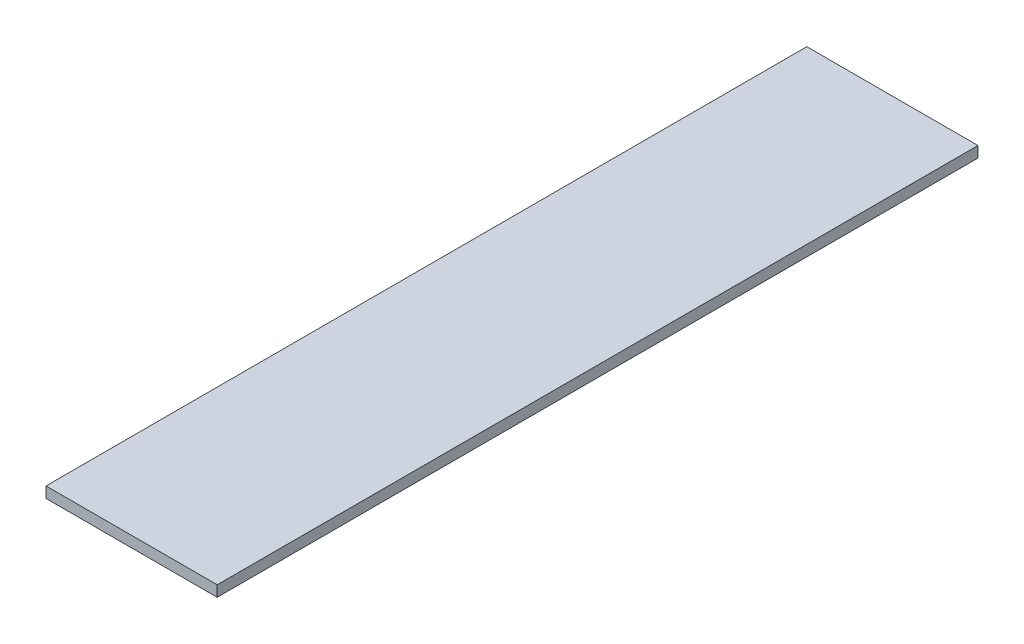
ISO-10303-21;
HEADER;
FILE_DESCRIPTION(('STEP AP214'),'2;1');
FILE_NAME('part.step','',(''),(''),'','','');
FILE_SCHEMA(('AUTOMOTIVE_DESIGN { 1 0 10303 214 1 1 1 1 }'));
ENDSEC;
DATA;
#1=APPLICATION_CONTEXT('core data for automotive mechanical design processes');
#2=APPLICATION_PROTOCOL_DEFINITION('international standard','automotive_design',2000,#1);
#3=PRODUCT_CONTEXT('',#1,'mechanical');
#4=PRODUCT('Part','Part','',(#3));
#5=PRODUCT_RELATED_PRODUCT_CATEGORY('part','',(#4));
#6=PRODUCT_DEFINITION_FORMATION('','',#4);
#7=PRODUCT_DEFINITION_CONTEXT('part definition',#1,'design');
#8=PRODUCT_DEFINITION('design','',#6,#7);
#9=PRODUCT_DEFINITION_SHAPE('','',#8);
#10=(LENGTH_UNIT() NAMED_UNIT(*) SI_UNIT(.MILLI.,.METRE.));
#11=(NAMED_UNIT(*) PLANE_ANGLE_UNIT() SI_UNIT($,.RADIAN.));
#12=(NAMED_UNIT(*) SI_UNIT($,.STERADIAN.) SOLID_ANGLE_UNIT());
#13=UNCERTAINTY_MEASURE_WITH_UNIT(LENGTH_MEASURE(1.E-05),#10,'distance_accuracy_value','');
#14=(GEOMETRIC_REPRESENTATION_CONTEXT(3) GLOBAL_UNCERTAINTY_ASSIGNED_CONTEXT((#13)) GLOBAL_UNIT_ASSIGNED_CONTEXT((#10,
#11,#12)) REPRESENTATION_CONTEXT('',''));
#15=CARTESIAN_POINT('',(0.,0.,0.));
#16=DIRECTION('',(0.,0.,1.));
#17=DIRECTION('',(1.,0.,0.));
#18=AXIS2_PLACEMENT_3D('',#15,#16,#17);
#19=CARTESIAN_POINT('',(100.0125,6.35,-444.5));
#20=DIRECTION('',(-1.,0.,0.));
#21=DIRECTION('',(0.,0.,1.));
#22=AXIS2_PLACEMENT_3D('',#19,#20,#21);
#23=PLANE('',#22);
#24=DIRECTION('',(0.,0.,-1.));
#25=VECTOR('',#24,1.);
#26=CARTESIAN_POINT('',(100.0125,-6.35,-444.5));
#27=LINE('',#26,#25);
#28=CARTESIAN_POINT('',(100.0125,-6.35,444.5));
#29=VERTEX_POINT('',#28);
#30=CARTESIAN_POINT('',(100.0125,-6.35,-444.5));
#31=VERTEX_POINT('',#30);
#32=EDGE_CURVE('E95',#29,#31,#27,.T.);
#33=ORIENTED_EDGE('',*,*,#32,.T.);
#34=DIRECTION('',(0.,-1.,0.));
#35=VECTOR('',#34,1.);
#36=CARTESIAN_POINT('',(100.0125,6.35,-444.5));
#37=LINE('',#36,#35);
#38=CARTESIAN_POINT('',(100.0125,6.35,-444.5));
#39=VERTEX_POINT('',#38);
#40=EDGE_CURVE('E11',#39,#31,#37,.T.);
#41=ORIENTED_EDGE('',*,*,#40,.F.);
#42=DIRECTION('',(0.,0.,-1.));
#43=VECTOR('',#42,1.);
#44=CARTESIAN_POINT('',(100.0125,6.35,-444.5));
#45=LINE('',#44,#43);
#46=CARTESIAN_POINT('',(100.0125,6.35,444.5));
#47=VERTEX_POINT('',#46);
#48=EDGE_CURVE('E83',#47,#39,#45,.T.);
#49=ORIENTED_EDGE('',*,*,#48,.F.);
#50=DIRECTION('',(0.,-1.,0.));
#51=VECTOR('',#50,1.);
#52=CARTESIAN_POINT('',(100.0125,6.35,444.5));
#53=LINE('',#52,#51);
#54=EDGE_CURVE('E91',#47,#29,#53,.T.);
#55=ORIENTED_EDGE('',*,*,#54,.T.);
#56=EDGE_LOOP('',(#33,#41,#49,#55));
#57=FACE_BOUND('',#56,.T.);
#58=ADVANCED_FACE('F32',(#57),#23,.F.);
#59=CARTESIAN_POINT('',(-100.0125,6.35,-444.5));
#60=DIRECTION('',(0.,0.,1.));
#61=DIRECTION('',(1.,0.,0.));
#62=AXIS2_PLACEMENT_3D('',#59,#60,#61);
#63=PLANE('',#62);
#64=DIRECTION('',(-1.,0.,0.));
#65=VECTOR('',#64,1.);
#66=CARTESIAN_POINT('',(-100.0125,-6.35,-444.5));
#67=LINE('',#66,#65);
#68=CARTESIAN_POINT('',(-100.0125,-6.35,-444.5));
#69=VERTEX_POINT('',#68);
#70=EDGE_CURVE('E87',#31,#69,#67,.T.);
#71=ORIENTED_EDGE('',*,*,#70,.T.);
#72=DIRECTION('',(0.,-1.,0.));
#73=VECTOR('',#72,1.);
#74=CARTESIAN_POINT('',(-100.0125,6.35,-444.5));
#75=LINE('',#74,#73);
#76=CARTESIAN_POINT('',(-100.0125,6.35,-444.5));
#77=VERTEX_POINT('',#76);
#78=EDGE_CURVE('E40',#77,#69,#75,.T.);
#79=ORIENTED_EDGE('',*,*,#78,.F.);
#80=DIRECTION('',(-1.,0.,0.));
#81=VECTOR('',#80,1.);
#82=CARTESIAN_POINT('',(-100.0125,6.35,-444.5));
#83=LINE('',#82,#81);
#84=EDGE_CURVE('E78',#39,#77,#83,.T.);
#85=ORIENTED_EDGE('',*,*,#84,.F.);
#86=ORIENTED_EDGE('',*,*,#40,.T.);
#87=EDGE_LOOP('',(#71,#79,#85,#86));
#88=FACE_BOUND('',#87,.T.);
#89=ADVANCED_FACE('F86',(#88),#63,.F.);
#90=CARTESIAN_POINT('',(-100.0125,6.35,-444.5));
#91=DIRECTION('',(1.,0.,0.));
#92=DIRECTION('',(0.,0.,-1.));
#93=AXIS2_PLACEMENT_3D('',#90,#91,#92);
#94=PLANE('',#93);
#95=DIRECTION('',(0.,0.,1.));
#96=VECTOR('',#95,1.);
#97=CARTESIAN_POINT('',(-100.0125,-6.35,-444.5));
#98=LINE('',#97,#96);
#99=CARTESIAN_POINT('',(-100.0125,-6.35,444.5));
#100=VERTEX_POINT('',#99);
#101=EDGE_CURVE('E65',#69,#100,#98,.T.);
#102=ORIENTED_EDGE('',*,*,#101,.T.);
#103=DIRECTION('',(0.,-1.,0.));
#104=VECTOR('',#103,1.);
#105=CARTESIAN_POINT('',(-100.0125,6.35,444.5));
#106=LINE('',#105,#104);
#107=CARTESIAN_POINT('',(-100.0125,6.35,444.5));
#108=VERTEX_POINT('',#107);
#109=EDGE_CURVE('E88',#108,#100,#106,.T.);
#110=ORIENTED_EDGE('',*,*,#109,.F.);
#111=DIRECTION('',(0.,0.,1.));
#112=VECTOR('',#111,1.);
#113=CARTESIAN_POINT('',(-100.0125,6.35,-444.5));
#114=LINE('',#113,#112);
#115=EDGE_CURVE('E81',#77,#108,#114,.T.);
#116=ORIENTED_EDGE('',*,*,#115,.F.);
#117=ORIENTED_EDGE('',*,*,#78,.T.);
#118=EDGE_LOOP('',(#102,#110,#116,#117));
#119=FACE_BOUND('',#118,.T.);
#120=ADVANCED_FACE('F89',(#119),#94,.F.);
#121=CARTESIAN_POINT('',(-100.0125,6.35,444.5));
#122=DIRECTION('',(0.,0.,-1.));
#123=DIRECTION('',(-1.,0.,0.));
#124=AXIS2_PLACEMENT_3D('',#121,#122,#123);
#125=PLANE('',#124);
#126=DIRECTION('',(1.,0.,0.));
#127=VECTOR('',#126,1.);
#128=CARTESIAN_POINT('',(-100.0125,-6.35,444.5));
#129=LINE('',#128,#127);
#130=EDGE_CURVE('E71',#100,#29,#129,.T.);
#131=ORIENTED_EDGE('',*,*,#130,.T.);
#132=ORIENTED_EDGE('',*,*,#54,.F.);
#133=DIRECTION('',(1.,0.,0.));
#134=VECTOR('',#133,1.);
#135=CARTESIAN_POINT('',(-100.0125,6.35,444.5));
#136=LINE('',#135,#134);
#137=EDGE_CURVE('E48',#108,#47,#136,.T.);
#138=ORIENTED_EDGE('',*,*,#137,.F.);
#139=ORIENTED_EDGE('',*,*,#109,.T.);
#140=EDGE_LOOP('',(#131,#132,#138,#139));
#141=FACE_BOUND('',#140,.T.);
#142=ADVANCED_FACE('F102',(#141),#125,.F.);
#143=CARTESIAN_POINT('',(100.0125,6.35,444.5));
#144=DIRECTION('',(0.,1.,0.));
#145=DIRECTION('',(0.,0.,1.));
#146=AXIS2_PLACEMENT_3D('',#143,#144,#145);
#147=PLANE('',#146);
#148=ORIENTED_EDGE('',*,*,#48,.T.);
#149=ORIENTED_EDGE('',*,*,#84,.T.);
#150=ORIENTED_EDGE('',*,*,#115,.T.);
#151=ORIENTED_EDGE('',*,*,#137,.T.);
#152=EDGE_LOOP('',(#148,#149,#150,#151));
#153=FACE_BOUND('',#152,.T.);
#154=ADVANCED_FACE('F79',(#153),#147,.T.);
#155=CARTESIAN_POINT('',(100.0125,-6.35,444.5));
#156=DIRECTION('',(0.,1.,0.));
#157=DIRECTION('',(0.,0.,1.));
#158=AXIS2_PLACEMENT_3D('',#155,#156,#157);
#159=PLANE('',#158);
#160=ORIENTED_EDGE('',*,*,#32,.F.);
#161=ORIENTED_EDGE('',*,*,#130,.F.);
#162=ORIENTED_EDGE('',*,*,#101,.F.);
#163=ORIENTED_EDGE('',*,*,#70,.F.);
#164=EDGE_LOOP('',(#160,#161,#162,#163));
#165=FACE_BOUND('',#164,.T.);
#166=ADVANCED_FACE('F105',(#165),#159,.F.);
#167=CLOSED_SHELL('',(#58,#89,#120,#142,#154,#166));
#168=MANIFOLD_SOLID_BREP('B2',#167);
#169=ADVANCED_BREP_SHAPE_REPRESENTATION('',(#18,#168),#14);
#170=SHAPE_DEFINITION_REPRESENTATION(#9,#169);
ENDSEC;
END-ISO-10303-21;
